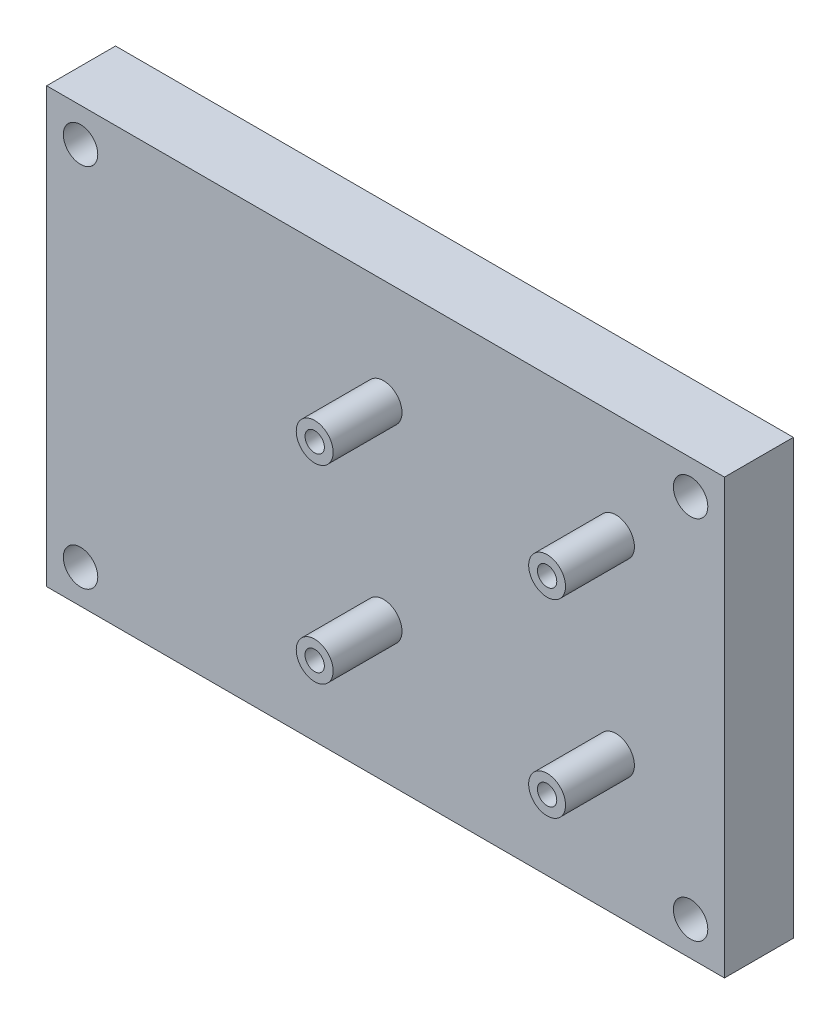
from build123d import *

# Parameters (mm, degrees)
SKETCH1_W                    = 125
SKETCH1_H                    = 80
BOSS_EXTRUDE1_DEPTH          = 12.7
SKETCH2_R                    = 3.175
CUT_EXTRUDE1_DEPTH           = 149.950629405
SKETCH3_R                    = 3.40194036
BOSS_EXTRUDE2_DEPTH          = 12.7
F_28_0_1405_DIAMETER_HOLE1_D = 3.5687


with BuildPart() as part:
    # Sketch1 → Boss-Extrude1 (new body)
    with BuildSketch(Plane.XY):
        with Locations((62.5, 40)):
            Rectangle(SKETCH1_W, SKETCH1_H)
    extrude(amount=BOSS_EXTRUDE1_DEPTH)

    # Sketch2 → Cut-Extrude1 (cut, through all)
    with BuildSketch(Plane.XY.offset(12.7)):
        with Locations((118.75, 73.75)):
            Circle(SKETCH2_R)
        with Locations((6.25, 6.25)):
            Circle(SKETCH2_R)
        with Locations((118.75, 6.25)):
            Circle(SKETCH2_R)
        with Locations((6.25, 73.75)):
            Circle(SKETCH2_R)
    extrude(amount=-CUT_EXTRUDE1_DEPTH, mode=Mode.SUBTRACT)

    # Sketch3 → Boss-Extrude2 (add)
    with BuildSketch(Plane.XY.offset(12.7)):
        with Locations(Location((62.12837096, 60.561410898, 0), (0, 0, 180))):
            Circle(SKETCH3_R)
        with Locations(Location((104.99087096, 60.561410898, 0), (0, 0, 180))):
            Circle(SKETCH3_R)
        with Locations(Location((62.12837096, 25.636410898, 0), (0, 0, 180))):
            Circle(SKETCH3_R)
        with Locations(Location((104.98837096, 25.636410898, 0), (0, 0, 180))):
            Circle(SKETCH3_R)
    extrude(amount=BOSS_EXTRUDE2_DEPTH)

    # 28 _0.1405_ Diameter Hole1 (through all)
    with Locations(Plane(origin=(62.12837096, 60.561410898, 25.4), x_dir=(1, 0, 0), z_dir=(0, 0, 1))):
        with Locations((0, 0), (42.8625, 0), (0, -34.925), (42.86, -34.925)):
            Hole(F_28_0_1405_DIAMETER_HOLE1_D / 2)


solid = part.part
